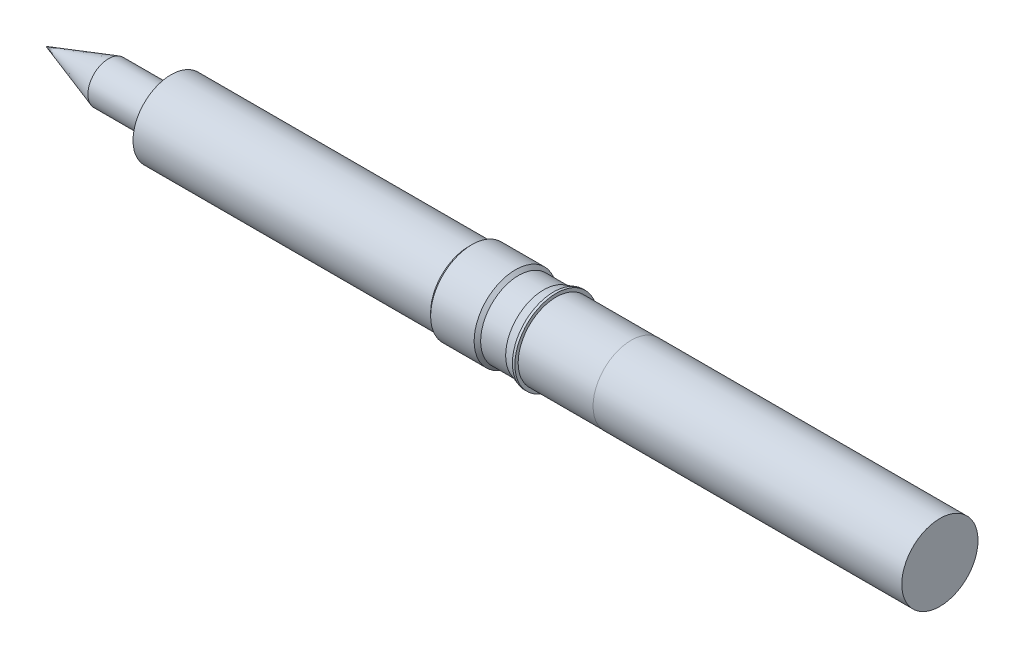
ISO-10303-21;
HEADER;
FILE_DESCRIPTION(('STEP AP214'),'2;1');
FILE_NAME('part.step','',(''),(''),'','','');
FILE_SCHEMA(('AUTOMOTIVE_DESIGN { 1 0 10303 214 1 1 1 1 }'));
ENDSEC;
DATA;
#1=APPLICATION_CONTEXT('core data for automotive mechanical design processes');
#2=APPLICATION_PROTOCOL_DEFINITION('international standard','automotive_design',2000,#1);
#3=PRODUCT_CONTEXT('',#1,'mechanical');
#4=PRODUCT('Part','Part','',(#3));
#5=PRODUCT_RELATED_PRODUCT_CATEGORY('part','',(#4));
#6=PRODUCT_DEFINITION_FORMATION('','',#4);
#7=PRODUCT_DEFINITION_CONTEXT('part definition',#1,'design');
#8=PRODUCT_DEFINITION('design','',#6,#7);
#9=PRODUCT_DEFINITION_SHAPE('','',#8);
#10=(LENGTH_UNIT() NAMED_UNIT(*) SI_UNIT(.MILLI.,.METRE.));
#11=(NAMED_UNIT(*) PLANE_ANGLE_UNIT() SI_UNIT($,.RADIAN.));
#12=(NAMED_UNIT(*) SI_UNIT($,.STERADIAN.) SOLID_ANGLE_UNIT());
#13=UNCERTAINTY_MEASURE_WITH_UNIT(LENGTH_MEASURE(1.E-05),#10,'distance_accuracy_value','');
#14=(GEOMETRIC_REPRESENTATION_CONTEXT(3) GLOBAL_UNCERTAINTY_ASSIGNED_CONTEXT((#13)) GLOBAL_UNIT_ASSIGNED_CONTEXT((#10,
#11,#12)) REPRESENTATION_CONTEXT('',''));
#15=CARTESIAN_POINT('',(0.,0.,0.));
#16=DIRECTION('',(0.,0.,1.));
#17=DIRECTION('',(1.,0.,0.));
#18=AXIS2_PLACEMENT_3D('',#15,#16,#17);
#19=CARTESIAN_POINT('',(30.39,0.,0.));
#20=DIRECTION('',(-1.,0.,0.));
#21=DIRECTION('',(0.,0.,1.));
#22=AXIS2_PLACEMENT_3D('',#19,#20,#21);
#23=CYLINDRICAL_SURFACE('',#22,1.524);
#24=CARTESIAN_POINT('',(23.4,0.,0.));
#25=DIRECTION('',(-1.,0.,0.));
#26=DIRECTION('',(0.,0.,1.));
#27=AXIS2_PLACEMENT_3D('',#24,#25,#26);
#28=CIRCLE('',#27,1.524);
#29=CARTESIAN_POINT('',(23.4,0.,1.524));
#30=VERTEX_POINT('',#29);
#31=EDGE_CURVE('E72',#30,#30,#28,.T.);
#32=ORIENTED_EDGE('',*,*,#31,.F.);
#33=EDGE_LOOP('',(#32));
#34=FACE_BOUND('',#33,.T.);
#35=CARTESIAN_POINT('',(35.7444,0.,0.));
#36=DIRECTION('',(1.,0.,0.));
#37=DIRECTION('',(0.,0.,-1.));
#38=AXIS2_PLACEMENT_3D('',#35,#36,#37);
#39=CIRCLE('',#38,1.524);
#40=CARTESIAN_POINT('',(35.7444,0.,-1.524));
#41=VERTEX_POINT('',#40);
#42=EDGE_CURVE('E75',#41,#41,#39,.T.);
#43=ORIENTED_EDGE('',*,*,#42,.F.);
#44=EDGE_LOOP('',(#43));
#45=FACE_BOUND('',#44,.T.);
#46=ADVANCED_FACE('F36',(#34,#45),#23,.T.);
#47=CARTESIAN_POINT('',(5.,0.,0.));
#48=DIRECTION('',(-1.,0.,0.));
#49=DIRECTION('',(0.,0.,1.));
#50=AXIS2_PLACEMENT_3D('',#47,#48,#49);
#51=PLANE('',#50);
#52=CARTESIAN_POINT('',(5.,0.,0.));
#53=DIRECTION('',(-1.,0.,0.));
#54=DIRECTION('',(0.,0.,1.));
#55=AXIS2_PLACEMENT_3D('',#52,#53,#54);
#56=CIRCLE('',#55,0.825);
#57=CARTESIAN_POINT('',(5.,0.,0.825));
#58=VERTEX_POINT('',#57);
#59=EDGE_CURVE('E76',#58,#58,#56,.T.);
#60=ORIENTED_EDGE('',*,*,#59,.F.);
#61=EDGE_LOOP('',(#60));
#62=FACE_BOUND('',#61,.T.);
#63=CARTESIAN_POINT('',(5.,0.,0.));
#64=DIRECTION('',(-1.,0.,0.));
#65=DIRECTION('',(0.,0.,1.));
#66=AXIS2_PLACEMENT_3D('',#63,#64,#65);
#67=CIRCLE('',#66,1.52);
#68=CARTESIAN_POINT('',(5.,0.,1.52));
#69=VERTEX_POINT('',#68);
#70=EDGE_CURVE('E11',#69,#69,#67,.T.);
#71=ORIENTED_EDGE('',*,*,#70,.T.);
#72=EDGE_LOOP('',(#71));
#73=FACE_BOUND('',#72,.T.);
#74=ADVANCED_FACE('F62',(#62,#73),#51,.T.);
#75=CARTESIAN_POINT('',(30.39,0.,0.));
#76=DIRECTION('',(-1.,0.,0.));
#77=DIRECTION('',(0.,0.,1.));
#78=AXIS2_PLACEMENT_3D('',#75,#76,#77);
#79=CYLINDRICAL_SURFACE('',#78,1.52);
#80=CARTESIAN_POINT('',(16.9,0.,0.));
#81=DIRECTION('',(-1.,0.,0.));
#82=DIRECTION('',(0.,0.,1.));
#83=AXIS2_PLACEMENT_3D('',#80,#81,#82);
#84=CIRCLE('',#83,1.52);
#85=CARTESIAN_POINT('',(16.9,0.,1.52));
#86=VERTEX_POINT('',#85);
#87=EDGE_CURVE('E42',#86,#86,#84,.T.);
#88=ORIENTED_EDGE('',*,*,#87,.T.);
#89=EDGE_LOOP('',(#88));
#90=FACE_BOUND('',#89,.T.);
#91=ORIENTED_EDGE('',*,*,#70,.F.);
#92=EDGE_LOOP('',(#91));
#93=FACE_BOUND('',#92,.T.);
#94=ADVANCED_FACE('F67',(#90,#93),#79,.T.);
#95=CARTESIAN_POINT('',(16.9,0.,0.));
#96=DIRECTION('',(1.,0.,0.));
#97=DIRECTION('',(0.,0.,-1.));
#98=AXIS2_PLACEMENT_3D('',#95,#96,#97);
#99=CONICAL_SURFACE('',#98,1.52,0.785398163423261);
#100=CARTESIAN_POINT('',(17.029999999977,0.,0.));
#101=DIRECTION('',(-1.,0.,0.));
#102=DIRECTION('',(0.,0.,1.));
#103=AXIS2_PLACEMENT_3D('',#100,#101,#102);
#104=CIRCLE('',#103,1.64999999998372);
#105=CARTESIAN_POINT('',(17.029999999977,0.,1.64999999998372));
#106=VERTEX_POINT('',#105);
#107=EDGE_CURVE('E105',#106,#106,#104,.T.);
#108=ORIENTED_EDGE('',*,*,#107,.T.);
#109=EDGE_LOOP('',(#108));
#110=FACE_BOUND('',#109,.T.);
#111=ORIENTED_EDGE('',*,*,#87,.F.);
#112=EDGE_LOOP('',(#111));
#113=FACE_BOUND('',#112,.T.);
#114=ADVANCED_FACE('F112',(#110,#113),#99,.T.);
#115=CARTESIAN_POINT('',(30.39,0.,0.));
#116=DIRECTION('',(-1.,0.,0.));
#117=DIRECTION('',(0.,0.,1.));
#118=AXIS2_PLACEMENT_3D('',#115,#116,#117);
#119=CYLINDRICAL_SURFACE('',#118,1.64999999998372);
#120=CARTESIAN_POINT('',(18.77,0.,0.));
#121=DIRECTION('',(-1.,0.,0.));
#122=DIRECTION('',(0.,0.,1.));
#123=AXIS2_PLACEMENT_3D('',#120,#121,#122);
#124=CIRCLE('',#123,1.64999999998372);
#125=CARTESIAN_POINT('',(18.77,0.,1.64999999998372));
#126=VERTEX_POINT('',#125);
#127=EDGE_CURVE('E102',#126,#126,#124,.T.);
#128=ORIENTED_EDGE('',*,*,#127,.T.);
#129=EDGE_LOOP('',(#128));
#130=FACE_BOUND('',#129,.T.);
#131=ORIENTED_EDGE('',*,*,#107,.F.);
#132=EDGE_LOOP('',(#131));
#133=FACE_BOUND('',#132,.T.);
#134=ADVANCED_FACE('F114',(#130,#133),#119,.T.);
#135=CARTESIAN_POINT('',(18.77,0.,0.));
#136=DIRECTION('',(-1.,0.,0.));
#137=DIRECTION('',(0.,0.,1.));
#138=AXIS2_PLACEMENT_3D('',#135,#136,#137);
#139=CONICAL_SURFACE('',#138,1.64999999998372,0.78539816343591);
#140=CARTESIAN_POINT('',(18.8999999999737,0.,0.));
#141=DIRECTION('',(-1.,0.,0.));
#142=DIRECTION('',(0.,0.,1.));
#143=AXIS2_PLACEMENT_3D('',#140,#141,#142);
#144=CIRCLE('',#143,1.52);
#145=CARTESIAN_POINT('',(18.8999999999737,0.,1.52));
#146=VERTEX_POINT('',#145);
#147=EDGE_CURVE('E99',#146,#146,#144,.T.);
#148=ORIENTED_EDGE('',*,*,#147,.T.);
#149=EDGE_LOOP('',(#148));
#150=FACE_BOUND('',#149,.T.);
#151=ORIENTED_EDGE('',*,*,#127,.F.);
#152=EDGE_LOOP('',(#151));
#153=FACE_BOUND('',#152,.T.);
#154=ADVANCED_FACE('F121',(#150,#153),#139,.T.);
#155=CARTESIAN_POINT('',(30.39,0.,0.));
#156=DIRECTION('',(-1.,0.,0.));
#157=DIRECTION('',(0.,0.,1.));
#158=AXIS2_PLACEMENT_3D('',#155,#156,#157);
#159=CYLINDRICAL_SURFACE('',#158,1.52);
#160=CARTESIAN_POINT('',(19.9,0.,0.));
#161=DIRECTION('',(-1.,0.,0.));
#162=DIRECTION('',(0.,0.,1.));
#163=AXIS2_PLACEMENT_3D('',#160,#161,#162);
#164=CIRCLE('',#163,1.52);
#165=CARTESIAN_POINT('',(19.9,0.,1.52));
#166=VERTEX_POINT('',#165);
#167=EDGE_CURVE('E96',#166,#166,#164,.T.);
#168=ORIENTED_EDGE('',*,*,#167,.T.);
#169=EDGE_LOOP('',(#168));
#170=FACE_BOUND('',#169,.T.);
#171=ORIENTED_EDGE('',*,*,#147,.F.);
#172=EDGE_LOOP('',(#171));
#173=FACE_BOUND('',#172,.T.);
#174=ADVANCED_FACE('F128',(#170,#173),#159,.T.);
#175=CARTESIAN_POINT('',(19.9,0.,0.));
#176=DIRECTION('',(1.,0.,0.));
#177=DIRECTION('',(0.,0.,-1.));
#178=AXIS2_PLACEMENT_3D('',#175,#176,#177);
#179=CONICAL_SURFACE('',#178,1.52,0.314231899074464);
#180=CARTESIAN_POINT('',(20.2999999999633,0.,0.));
#181=DIRECTION('',(-1.,0.,0.));
#182=DIRECTION('',(0.,0.,1.));
#183=AXIS2_PLACEMENT_3D('',#180,#181,#182);
#184=CIRCLE('',#183,1.64999999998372);
#185=CARTESIAN_POINT('',(20.2999999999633,0.,1.64999999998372));
#186=VERTEX_POINT('',#185);
#187=EDGE_CURVE('E93',#186,#186,#184,.T.);
#188=ORIENTED_EDGE('',*,*,#187,.T.);
#189=EDGE_LOOP('',(#188));
#190=FACE_BOUND('',#189,.T.);
#191=ORIENTED_EDGE('',*,*,#167,.F.);
#192=EDGE_LOOP('',(#191));
#193=FACE_BOUND('',#192,.T.);
#194=ADVANCED_FACE('F132',(#190,#193),#179,.T.);
#195=CARTESIAN_POINT('',(30.39,0.,0.));
#196=DIRECTION('',(-1.,0.,0.));
#197=DIRECTION('',(0.,0.,1.));
#198=AXIS2_PLACEMENT_3D('',#195,#196,#197);
#199=CYLINDRICAL_SURFACE('',#198,1.64999999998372);
#200=CARTESIAN_POINT('',(20.4,0.,0.));
#201=DIRECTION('',(-1.,0.,0.));
#202=DIRECTION('',(0.,0.,1.));
#203=AXIS2_PLACEMENT_3D('',#200,#201,#202);
#204=CIRCLE('',#203,1.64999999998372);
#205=CARTESIAN_POINT('',(20.4,0.,1.64999999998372));
#206=VERTEX_POINT('',#205);
#207=EDGE_CURVE('E90',#206,#206,#204,.T.);
#208=ORIENTED_EDGE('',*,*,#207,.T.);
#209=EDGE_LOOP('',(#208));
#210=FACE_BOUND('',#209,.T.);
#211=ORIENTED_EDGE('',*,*,#187,.F.);
#212=EDGE_LOOP('',(#211));
#213=FACE_BOUND('',#212,.T.);
#214=ADVANCED_FACE('F136',(#210,#213),#199,.T.);
#215=CARTESIAN_POINT('',(20.4,1.64999999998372,0.));
#216=DIRECTION('',(1.,0.,0.));
#217=DIRECTION('',(0.,0.,-1.));
#218=AXIS2_PLACEMENT_3D('',#215,#216,#217);
#219=PLANE('',#218);
#220=CARTESIAN_POINT('',(20.4,0.,0.));
#221=DIRECTION('',(-1.,0.,0.));
#222=DIRECTION('',(0.,0.,1.));
#223=AXIS2_PLACEMENT_3D('',#220,#221,#222);
#224=CIRCLE('',#223,1.52);
#225=CARTESIAN_POINT('',(20.4,0.,1.52));
#226=VERTEX_POINT('',#225);
#227=EDGE_CURVE('E87',#226,#226,#224,.T.);
#228=ORIENTED_EDGE('',*,*,#227,.T.);
#229=EDGE_LOOP('',(#228));
#230=FACE_BOUND('',#229,.T.);
#231=ORIENTED_EDGE('',*,*,#207,.F.);
#232=EDGE_LOOP('',(#231));
#233=FACE_BOUND('',#232,.T.);
#234=ADVANCED_FACE('F140',(#230,#233),#219,.T.);
#235=CARTESIAN_POINT('',(30.39,0.,0.));
#236=DIRECTION('',(-1.,0.,0.));
#237=DIRECTION('',(0.,0.,1.));
#238=AXIS2_PLACEMENT_3D('',#235,#236,#237);
#239=CYLINDRICAL_SURFACE('',#238,1.52);
#240=CARTESIAN_POINT('',(23.4,0.,0.));
#241=DIRECTION('',(-1.,0.,0.));
#242=DIRECTION('',(0.,0.,1.));
#243=AXIS2_PLACEMENT_3D('',#240,#241,#242);
#244=CIRCLE('',#243,1.52);
#245=CARTESIAN_POINT('',(23.4,0.,1.52));
#246=VERTEX_POINT('',#245);
#247=EDGE_CURVE('E84',#246,#246,#244,.T.);
#248=ORIENTED_EDGE('',*,*,#247,.T.);
#249=EDGE_LOOP('',(#248));
#250=FACE_BOUND('',#249,.T.);
#251=ORIENTED_EDGE('',*,*,#227,.F.);
#252=EDGE_LOOP('',(#251));
#253=FACE_BOUND('',#252,.T.);
#254=ADVANCED_FACE('F144',(#250,#253),#239,.T.);
#255=CARTESIAN_POINT('',(23.4,1.52,0.));
#256=DIRECTION('',(-1.,0.,0.));
#257=DIRECTION('',(0.,0.,1.));
#258=AXIS2_PLACEMENT_3D('',#255,#256,#257);
#259=PLANE('',#258);
#260=ORIENTED_EDGE('',*,*,#31,.T.);
#261=EDGE_LOOP('',(#260));
#262=FACE_BOUND('',#261,.T.);
#263=ORIENTED_EDGE('',*,*,#247,.F.);
#264=EDGE_LOOP('',(#263));
#265=FACE_BOUND('',#264,.T.);
#266=ADVANCED_FACE('F57',(#262,#265),#259,.T.);
#267=CARTESIAN_POINT('',(2.5,0.,0.));
#268=DIRECTION('',(1.,0.,0.));
#269=DIRECTION('',(0.,0.,-1.));
#270=AXIS2_PLACEMENT_3D('',#267,#268,#269);
#271=CYLINDRICAL_SURFACE('',#270,0.825);
#272=CARTESIAN_POINT('',(2.5,0.,0.));
#273=DIRECTION('',(-1.,0.,0.));
#274=DIRECTION('',(0.,0.,1.));
#275=AXIS2_PLACEMENT_3D('',#272,#273,#274);
#276=CIRCLE('',#275,0.825);
#277=CARTESIAN_POINT('',(2.5,0.,0.825));
#278=VERTEX_POINT('',#277);
#279=EDGE_CURVE('E79',#278,#278,#276,.T.);
#280=ORIENTED_EDGE('',*,*,#279,.F.);
#281=EDGE_LOOP('',(#280));
#282=FACE_BOUND('',#281,.T.);
#283=ORIENTED_EDGE('',*,*,#59,.T.);
#284=EDGE_LOOP('',(#283));
#285=FACE_BOUND('',#284,.T.);
#286=ADVANCED_FACE('F48',(#282,#285),#271,.T.);
#287=CARTESIAN_POINT('',(-1.13686837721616E-10,0.,0.));
#288=DIRECTION('',(1.,0.,0.));
#289=DIRECTION('',(0.,0.,-1.));
#290=AXIS2_PLACEMENT_3D('',#287,#288,#289);
#291=CONICAL_SURFACE('',#290,0.,0.318747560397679);
#292=ORIENTED_EDGE('',*,*,#279,.T.);
#293=EDGE_LOOP('',(#292));
#294=FACE_BOUND('',#293,.T.);
#295=CARTESIAN_POINT('',(-1.13686837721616E-10,0.,0.));
#296=VERTEX_POINT('',#295);
#297=VERTEX_LOOP('',#296);
#298=FACE_BOUND('',#297,.T.);
#299=ADVANCED_FACE('F45',(#294,#298),#291,.T.);
#300=CARTESIAN_POINT('',(35.7444,0.,0.));
#301=DIRECTION('',(1.,0.,0.));
#302=DIRECTION('',(0.,0.,-1.));
#303=AXIS2_PLACEMENT_3D('',#300,#301,#302);
#304=PLANE('',#303);
#305=ORIENTED_EDGE('',*,*,#42,.T.);
#306=EDGE_LOOP('',(#305));
#307=FACE_BOUND('',#306,.T.);
#308=ADVANCED_FACE('F47',(#307),#304,.T.);
#309=CLOSED_SHELL('',(#46,#74,#94,#114,#134,#154,#174,#194,#214,#234,#254,#266,#286,#299,#308));
#310=MANIFOLD_SOLID_BREP('B2',#309);
#311=ADVANCED_BREP_SHAPE_REPRESENTATION('',(#18,#310),#14);
#312=SHAPE_DEFINITION_REPRESENTATION(#9,#311);
ENDSEC;
END-ISO-10303-21;
